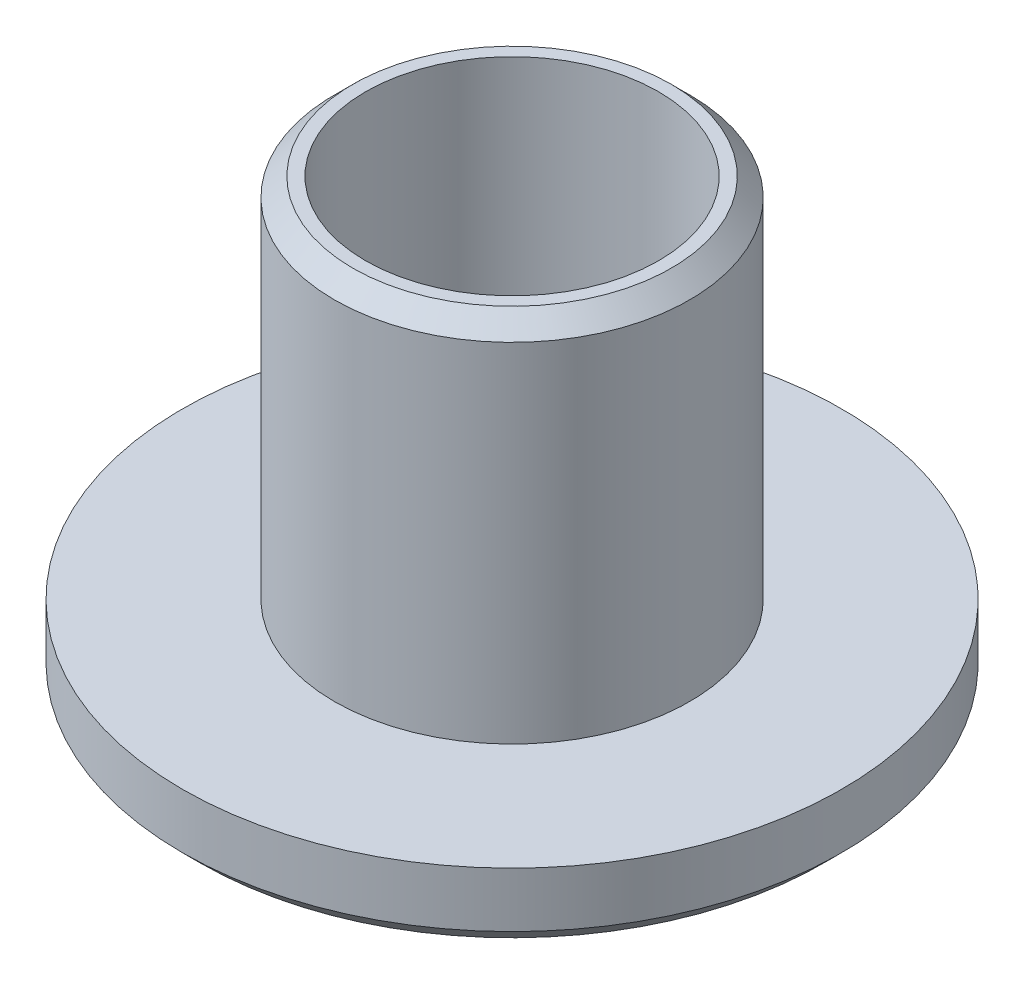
ISO-10303-21;
HEADER;
FILE_DESCRIPTION(('STEP AP214'),'2;1');
FILE_NAME('part.step','',(''),(''),'','','');
FILE_SCHEMA(('AUTOMOTIVE_DESIGN { 1 0 10303 214 1 1 1 1 }'));
ENDSEC;
DATA;
#1=APPLICATION_CONTEXT('core data for automotive mechanical design processes');
#2=APPLICATION_PROTOCOL_DEFINITION('international standard','automotive_design',2000,#1);
#3=PRODUCT_CONTEXT('',#1,'mechanical');
#4=PRODUCT('Part','Part','',(#3));
#5=PRODUCT_RELATED_PRODUCT_CATEGORY('part','',(#4));
#6=PRODUCT_DEFINITION_FORMATION('','',#4);
#7=PRODUCT_DEFINITION_CONTEXT('part definition',#1,'design');
#8=PRODUCT_DEFINITION('design','',#6,#7);
#9=PRODUCT_DEFINITION_SHAPE('','',#8);
#10=(LENGTH_UNIT() NAMED_UNIT(*) SI_UNIT(.MILLI.,.METRE.));
#11=(NAMED_UNIT(*) PLANE_ANGLE_UNIT() SI_UNIT($,.RADIAN.));
#12=(NAMED_UNIT(*) SI_UNIT($,.STERADIAN.) SOLID_ANGLE_UNIT());
#13=UNCERTAINTY_MEASURE_WITH_UNIT(LENGTH_MEASURE(1.E-05),#10,'distance_accuracy_value','');
#14=(GEOMETRIC_REPRESENTATION_CONTEXT(3) GLOBAL_UNCERTAINTY_ASSIGNED_CONTEXT((#13)) GLOBAL_UNIT_ASSIGNED_CONTEXT((#10,
#11,#12)) REPRESENTATION_CONTEXT('',''));
#15=CARTESIAN_POINT('',(0.,0.,0.));
#16=DIRECTION('',(0.,0.,1.));
#17=DIRECTION('',(1.,0.,0.));
#18=AXIS2_PLACEMENT_3D('',#15,#16,#17);
#19=CARTESIAN_POINT('',(0.,2.,0.));
#20=DIRECTION('',(0.,1.,0.));
#21=DIRECTION('',(0.,0.,1.));
#22=AXIS2_PLACEMENT_3D('',#19,#20,#21);
#23=PLANE('',#22);
#24=CARTESIAN_POINT('',(0.,2.,0.));
#25=DIRECTION('',(0.,1.,0.));
#26=DIRECTION('',(0.,0.,1.));
#27=AXIS2_PLACEMENT_3D('',#24,#25,#26);
#28=CIRCLE('',#27,9.);
#29=CARTESIAN_POINT('',(0.,2.,9.));
#30=VERTEX_POINT('',#29);
#31=EDGE_CURVE('E64',#30,#30,#28,.T.);
#32=ORIENTED_EDGE('',*,*,#31,.T.);
#33=EDGE_LOOP('',(#32));
#34=FACE_BOUND('',#33,.T.);
#35=CARTESIAN_POINT('',(0.,2.,0.));
#36=DIRECTION('',(0.,1.,0.));
#37=DIRECTION('',(0.,0.,1.));
#38=AXIS2_PLACEMENT_3D('',#35,#36,#37);
#39=CIRCLE('',#38,4.85);
#40=CARTESIAN_POINT('',(0.,2.,4.85));
#41=VERTEX_POINT('',#40);
#42=EDGE_CURVE('E72',#41,#41,#39,.T.);
#43=ORIENTED_EDGE('',*,*,#42,.F.);
#44=EDGE_LOOP('',(#43));
#45=FACE_BOUND('',#44,.T.);
#46=ADVANCED_FACE('F39',(#34,#45),#23,.T.);
#47=CARTESIAN_POINT('',(0.,0.,0.));
#48=DIRECTION('',(0.,1.,0.));
#49=DIRECTION('',(0.,0.,1.));
#50=AXIS2_PLACEMENT_3D('',#47,#48,#49);
#51=PLANE('',#50);
#52=CARTESIAN_POINT('',(0.,0.,0.));
#53=DIRECTION('',(0.,1.,0.));
#54=DIRECTION('',(0.,0.,1.));
#55=AXIS2_PLACEMENT_3D('',#52,#53,#54);
#56=CIRCLE('',#55,8.5);
#57=CARTESIAN_POINT('',(0.,0.,8.5));
#58=VERTEX_POINT('',#57);
#59=EDGE_CURVE('E53',#58,#58,#56,.F.);
#60=ORIENTED_EDGE('',*,*,#59,.T.);
#61=EDGE_LOOP('',(#60));
#62=FACE_BOUND('',#61,.T.);
#63=CARTESIAN_POINT('',(0.,0.,0.));
#64=DIRECTION('',(0.,1.,0.));
#65=DIRECTION('',(0.,0.,1.));
#66=AXIS2_PLACEMENT_3D('',#63,#64,#65);
#67=CIRCLE('',#66,4.);
#68=CARTESIAN_POINT('',(0.,0.,4.));
#69=VERTEX_POINT('',#68);
#70=EDGE_CURVE('E68',#69,#69,#67,.T.);
#71=ORIENTED_EDGE('',*,*,#70,.T.);
#72=EDGE_LOOP('',(#71));
#73=FACE_BOUND('',#72,.T.);
#74=ADVANCED_FACE('F97',(#62,#73),#51,.F.);
#75=CARTESIAN_POINT('',(0.,2.,0.));
#76=DIRECTION('',(0.,-1.,0.));
#77=DIRECTION('',(0.,0.,-1.));
#78=AXIS2_PLACEMENT_3D('',#75,#76,#77);
#79=CYLINDRICAL_SURFACE('',#78,9.);
#80=CARTESIAN_POINT('',(0.,0.5,0.));
#81=DIRECTION('',(0.,1.,0.));
#82=DIRECTION('',(0.,0.,1.));
#83=AXIS2_PLACEMENT_3D('',#80,#81,#82);
#84=CIRCLE('',#83,9.);
#85=CARTESIAN_POINT('',(0.,0.5,9.));
#86=VERTEX_POINT('',#85);
#87=EDGE_CURVE('E58',#86,#86,#84,.T.);
#88=ORIENTED_EDGE('',*,*,#87,.T.);
#89=EDGE_LOOP('',(#88));
#90=FACE_BOUND('',#89,.T.);
#91=ORIENTED_EDGE('',*,*,#31,.F.);
#92=EDGE_LOOP('',(#91));
#93=FACE_BOUND('',#92,.T.);
#94=ADVANCED_FACE('F93',(#90,#93),#79,.T.);
#95=CARTESIAN_POINT('',(0.,2.,0.));
#96=DIRECTION('',(0.,-1.,0.));
#97=DIRECTION('',(0.,0.,-1.));
#98=AXIS2_PLACEMENT_3D('',#95,#96,#97);
#99=CYLINDRICAL_SURFACE('',#98,4.);
#100=ORIENTED_EDGE('',*,*,#70,.F.);
#101=EDGE_LOOP('',(#100));
#102=FACE_BOUND('',#101,.T.);
#103=CARTESIAN_POINT('',(0.,12.,0.));
#104=DIRECTION('',(0.,1.,0.));
#105=DIRECTION('',(0.,0.,1.));
#106=AXIS2_PLACEMENT_3D('',#103,#104,#105);
#107=CIRCLE('',#106,4.);
#108=CARTESIAN_POINT('',(0.,12.,4.));
#109=VERTEX_POINT('',#108);
#110=EDGE_CURVE('E76',#109,#109,#107,.T.);
#111=ORIENTED_EDGE('',*,*,#110,.T.);
#112=EDGE_LOOP('',(#111));
#113=FACE_BOUND('',#112,.T.);
#114=ADVANCED_FACE('F81',(#102,#113),#99,.F.);
#115=CARTESIAN_POINT('',(0.,12.,0.));
#116=DIRECTION('',(0.,1.,0.));
#117=DIRECTION('',(0.,0.,1.));
#118=AXIS2_PLACEMENT_3D('',#115,#116,#117);
#119=PLANE('',#118);
#120=CARTESIAN_POINT('',(0.,12.,0.));
#121=DIRECTION('',(0.,1.,0.));
#122=DIRECTION('',(0.,0.,1.));
#123=AXIS2_PLACEMENT_3D('',#120,#121,#122);
#124=CIRCLE('',#123,4.35);
#125=CARTESIAN_POINT('',(0.,12.,4.35));
#126=VERTEX_POINT('',#125);
#127=EDGE_CURVE('E48',#126,#126,#124,.T.);
#128=ORIENTED_EDGE('',*,*,#127,.T.);
#129=EDGE_LOOP('',(#128));
#130=FACE_BOUND('',#129,.T.);
#131=ORIENTED_EDGE('',*,*,#110,.F.);
#132=EDGE_LOOP('',(#131));
#133=FACE_BOUND('',#132,.T.);
#134=ADVANCED_FACE('F83',(#130,#133),#119,.T.);
#135=CARTESIAN_POINT('',(0.,12.,0.));
#136=DIRECTION('',(0.,-1.,0.));
#137=DIRECTION('',(0.,0.,-1.));
#138=AXIS2_PLACEMENT_3D('',#135,#136,#137);
#139=CYLINDRICAL_SURFACE('',#138,4.85);
#140=CARTESIAN_POINT('',(0.,11.5,0.));
#141=DIRECTION('',(0.,1.,0.));
#142=DIRECTION('',(0.,0.,1.));
#143=AXIS2_PLACEMENT_3D('',#140,#141,#142);
#144=CIRCLE('',#143,4.85);
#145=CARTESIAN_POINT('',(0.,11.5,4.85));
#146=VERTEX_POINT('',#145);
#147=EDGE_CURVE('E10',#146,#146,#144,.F.);
#148=ORIENTED_EDGE('',*,*,#147,.T.);
#149=EDGE_LOOP('',(#148));
#150=FACE_BOUND('',#149,.T.);
#151=ORIENTED_EDGE('',*,*,#42,.T.);
#152=EDGE_LOOP('',(#151));
#153=FACE_BOUND('',#152,.T.);
#154=ADVANCED_FACE('F85',(#150,#153),#139,.T.);
#155=CARTESIAN_POINT('',(0.,0.5,0.));
#156=DIRECTION('',(0.,1.,0.));
#157=DIRECTION('',(0.,0.,1.));
#158=AXIS2_PLACEMENT_3D('',#155,#156,#157);
#159=CONICAL_SURFACE('',#158,9.,0.78539816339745);
#160=ORIENTED_EDGE('',*,*,#59,.F.);
#161=EDGE_LOOP('',(#160));
#162=FACE_BOUND('',#161,.T.);
#163=ORIENTED_EDGE('',*,*,#87,.F.);
#164=EDGE_LOOP('',(#163));
#165=FACE_BOUND('',#164,.T.);
#166=ADVANCED_FACE('F91',(#162,#165),#159,.T.);
#167=CARTESIAN_POINT('',(0.,12.,0.));
#168=DIRECTION('',(0.,-1.,0.));
#169=DIRECTION('',(0.,0.,-1.));
#170=AXIS2_PLACEMENT_3D('',#167,#168,#169);
#171=CONICAL_SURFACE('',#170,4.35,0.785398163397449);
#172=ORIENTED_EDGE('',*,*,#147,.F.);
#173=EDGE_LOOP('',(#172));
#174=FACE_BOUND('',#173,.T.);
#175=ORIENTED_EDGE('',*,*,#127,.F.);
#176=EDGE_LOOP('',(#175));
#177=FACE_BOUND('',#176,.T.);
#178=ADVANCED_FACE('F42',(#174,#177),#171,.T.);
#179=CLOSED_SHELL('',(#46,#74,#94,#114,#134,#154,#166,#178));
#180=MANIFOLD_SOLID_BREP('B2',#179);
#181=ADVANCED_BREP_SHAPE_REPRESENTATION('',(#18,#180),#14);
#182=SHAPE_DEFINITION_REPRESENTATION(#9,#181);
ENDSEC;
END-ISO-10303-21;
